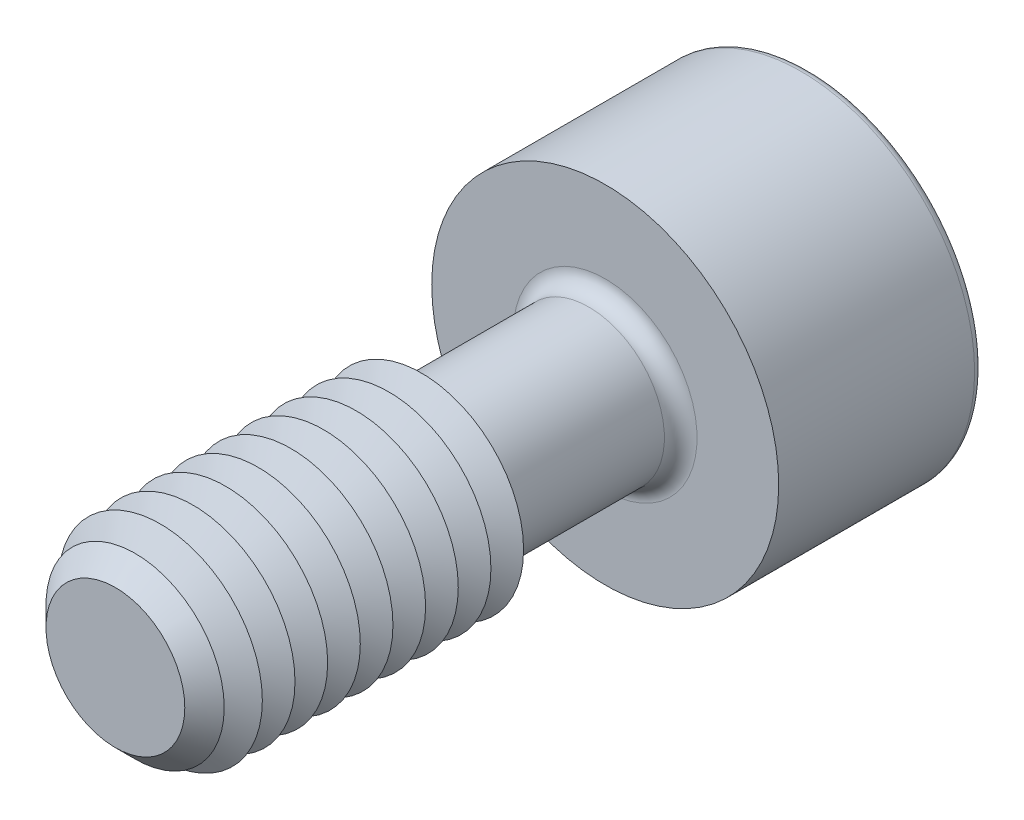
from build123d import *

# Parameters (mm, degrees)
SKETCH1_R       = 1.85
EXTRUDE1_DEPTH  = 6
CHAMFER1_SIZE   = 0.8
SKETCH3_R       = 4.25
EXTRUDE2_DEPTH  = 5
EXTRUDE3_DEPTH  = 4
FILLET1_R       = 0.4
FILLET2_R       = 0.2
LPATTERN1_COUNT = 9
LPATTERN1_PITCH = 0.8


with BuildPart() as part:
    # Sketch1 → Extrude1 (new, symmetric)
    with BuildSketch(Plane.XY):
        Circle(SKETCH1_R)
    extrude(amount=EXTRUDE1_DEPTH, both=True)

    # Sketch2 → Revolve1 (revolve)
    with BuildSketch(Plane(origin=(0, 0, 0), x_dir=(0, 0, -1), z_dir=(1, 0, 0))):
        Polygon((-6, 0), (-6, 2.5), (1.5, 2.5), (1.875277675, 1.85), (1.875277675, 0), align=None)
    revolve(axis=Axis((0, 0, -1.875277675), (0, 0, 1)))

    # Chamfer1
    chamfer1_edges = [part.edges().sort_by_distance(p)[0] for p in [
        (0, -2.5, 6),
    ]]
    chamfer(chamfer1_edges, length=CHAMFER1_SIZE)

    # Sketch3 → Extrude2 (add)
    with BuildSketch(Plane(origin=(0, 0, -6), x_dir=(-1, 0, 0), z_dir=(0, 0, -1))):
        Circle(SKETCH3_R)
    extrude(amount=EXTRUDE2_DEPTH)

    # Sketch4 → Extrude3 (cut)
    with BuildSketch(Plane(origin=(-13.7, 0, -11), x_dir=(1, 0, 0), z_dir=(0, 0, 1))):
        Polygon((12.545299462, -2), (14.854700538, -2), (16.009401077, 0), (14.854700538, 2), (12.545299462, 2), (11.390598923, 0), align=None)
    extrude(amount=EXTRUDE3_DEPTH, mode=Mode.SUBTRACT)

    # Fillet1
    fillet1_edges = [part.edges().sort_by_distance(p)[0] for p in [
        (-1.85, 0, -6),
    ]]
    fillet(fillet1_edges, radius=FILLET1_R)

    # Fillet2
    fillet2_edges = [part.edges().sort_by_distance(p)[0] for p in [
        (4.25, 0, -11),
    ]]
    fillet(fillet2_edges, radius=FILLET2_R)

    # Sketch5 → Cut-Revolve1 (revolve, cut)
    with BuildSketch(Plane(origin=(0, 0, 0), x_dir=(0, 0, -1), z_dir=(1, 0, 0)), mode=Mode.PRIVATE) as cut_revolve1_sk:
        Polygon((7, 0), (7, -2), (5.845299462, 0), align=None)
    revolve(cut_revolve1_sk.sketch.rotate(Axis((0, 0, -5.845299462), (0, 0, -1)), 90), axis=Axis((0, 0, -5.845299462), (0, 0, -1)), mode=Mode.SUBTRACT)

    # Sketch7 → Cut-Revolve2 (revolve, cut)
    with BuildSketch(Plane(origin=(0, 0, 0), x_dir=(0, 0, -1), z_dir=(1, 0, 0)), mode=Mode.PRIVATE) as cut_revolve2_sk:
        Polygon((1.5, 2.5), (1.1, 1.807179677), (0.7, 2.5), align=None)
    cut_revolve2 = revolve(cut_revolve2_sk.sketch.rotate(Axis((0, 0, -1.332048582), (0, 0, 1)), 90), axis=Axis((0, 0, -1.332048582), (0, 0, 1)), mode=Mode.SUBTRACT)

    # LPattern1: Cut-Revolve2 ×9
    with Locations(*[(0, 0, i * LPATTERN1_PITCH) for i in range(1, LPATTERN1_COUNT)]):
        add(cut_revolve2, mode=Mode.SUBTRACT)


solid = part.part
